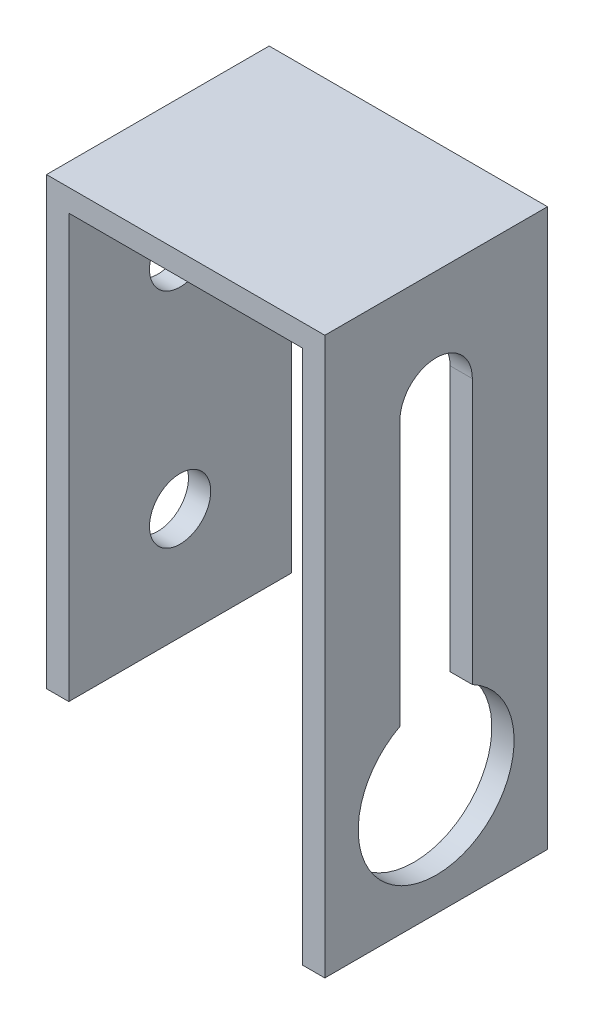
ISO-10303-21;
HEADER;
FILE_DESCRIPTION(('STEP AP214'),'2;1');
FILE_NAME('part.step','',(''),(''),'','','');
FILE_SCHEMA(('AUTOMOTIVE_DESIGN { 1 0 10303 214 1 1 1 1 }'));
ENDSEC;
DATA;
#1=APPLICATION_CONTEXT('core data for automotive mechanical design processes');
#2=APPLICATION_PROTOCOL_DEFINITION('international standard','automotive_design',2000,#1);
#3=PRODUCT_CONTEXT('',#1,'mechanical');
#4=PRODUCT('Part','Part','',(#3));
#5=PRODUCT_RELATED_PRODUCT_CATEGORY('part','',(#4));
#6=PRODUCT_DEFINITION_FORMATION('','',#4);
#7=PRODUCT_DEFINITION_CONTEXT('part definition',#1,'design');
#8=PRODUCT_DEFINITION('design','',#6,#7);
#9=PRODUCT_DEFINITION_SHAPE('','',#8);
#10=(LENGTH_UNIT() NAMED_UNIT(*) SI_UNIT(.MILLI.,.METRE.));
#11=(NAMED_UNIT(*) PLANE_ANGLE_UNIT() SI_UNIT($,.RADIAN.));
#12=(NAMED_UNIT(*) SI_UNIT($,.STERADIAN.) SOLID_ANGLE_UNIT());
#13=UNCERTAINTY_MEASURE_WITH_UNIT(LENGTH_MEASURE(1.E-05),#10,'distance_accuracy_value','');
#14=(GEOMETRIC_REPRESENTATION_CONTEXT(3) GLOBAL_UNCERTAINTY_ASSIGNED_CONTEXT((#13)) GLOBAL_UNIT_ASSIGNED_CONTEXT((#10,
#11,#12)) REPRESENTATION_CONTEXT('',''));
#15=CARTESIAN_POINT('',(0.,0.,0.));
#16=DIRECTION('',(0.,0.,1.));
#17=DIRECTION('',(1.,0.,0.));
#18=AXIS2_PLACEMENT_3D('',#15,#16,#17);
#19=CARTESIAN_POINT('',(2.,0.,20.));
#20=DIRECTION('',(0.,1.,0.));
#21=DIRECTION('',(0.,0.,1.));
#22=AXIS2_PLACEMENT_3D('',#19,#20,#21);
#23=PLANE('',#22);
#24=DIRECTION('',(1.,0.,0.));
#25=VECTOR('',#24,1.);
#26=CARTESIAN_POINT('',(2.,0.,0.));
#27=LINE('',#26,#25);
#28=CARTESIAN_POINT('',(0.,0.,0.));
#29=VERTEX_POINT('',#28);
#30=CARTESIAN_POINT('',(2.,0.,0.));
#31=VERTEX_POINT('',#30);
#32=EDGE_CURVE('E149',#29,#31,#27,.T.);
#33=ORIENTED_EDGE('',*,*,#32,.T.);
#34=DIRECTION('',(0.,0.,-1.));
#35=VECTOR('',#34,1.);
#36=CARTESIAN_POINT('',(2.,0.,20.));
#37=LINE('',#36,#35);
#38=CARTESIAN_POINT('',(2.,0.,20.));
#39=VERTEX_POINT('',#38);
#40=EDGE_CURVE('E11',#39,#31,#37,.T.);
#41=ORIENTED_EDGE('',*,*,#40,.F.);
#42=DIRECTION('',(1.,0.,0.));
#43=VECTOR('',#42,1.);
#44=CARTESIAN_POINT('',(2.,0.,20.));
#45=LINE('',#44,#43);
#46=CARTESIAN_POINT('',(0.,0.,20.));
#47=VERTEX_POINT('',#46);
#48=EDGE_CURVE('E152',#47,#39,#45,.T.);
#49=ORIENTED_EDGE('',*,*,#48,.F.);
#50=DIRECTION('',(0.,0.,-1.));
#51=VECTOR('',#50,1.);
#52=CARTESIAN_POINT('',(0.,0.,20.));
#53=LINE('',#52,#51);
#54=EDGE_CURVE('E170',#47,#29,#53,.T.);
#55=ORIENTED_EDGE('',*,*,#54,.T.);
#56=EDGE_LOOP('',(#33,#41,#49,#55));
#57=FACE_BOUND('',#56,.T.);
#58=ADVANCED_FACE('F33',(#57),#23,.F.);
#59=CARTESIAN_POINT('',(2.,0.,20.));
#60=DIRECTION('',(-1.,0.,0.));
#61=DIRECTION('',(0.,0.,1.));
#62=AXIS2_PLACEMENT_3D('',#59,#60,#61);
#63=PLANE('',#62);
#64=CARTESIAN_POINT('',(2.,10.,10.));
#65=DIRECTION('',(1.,0.,0.));
#66=DIRECTION('',(0.,0.,-1.));
#67=AXIS2_PLACEMENT_3D('',#64,#65,#66);
#68=CIRCLE('',#67,2.75);
#69=CARTESIAN_POINT('',(2.,10.,7.25));
#70=VERTEX_POINT('',#69);
#71=EDGE_CURVE('E283',#70,#70,#68,.T.);
#72=ORIENTED_EDGE('',*,*,#71,.F.);
#73=EDGE_LOOP('',(#72));
#74=FACE_BOUND('',#73,.T.);
#75=CARTESIAN_POINT('',(2.,30.,10.));
#76=DIRECTION('',(1.,0.,0.));
#77=DIRECTION('',(0.,0.,-1.));
#78=AXIS2_PLACEMENT_3D('',#75,#76,#77);
#79=CIRCLE('',#78,2.75);
#80=CARTESIAN_POINT('',(2.,30.,7.25));
#81=VERTEX_POINT('',#80);
#82=EDGE_CURVE('E277',#81,#81,#79,.T.);
#83=ORIENTED_EDGE('',*,*,#82,.F.);
#84=EDGE_LOOP('',(#83));
#85=FACE_BOUND('',#84,.T.);
#86=DIRECTION('',(0.,1.,0.));
#87=VECTOR('',#86,1.);
#88=CARTESIAN_POINT('',(2.,0.,0.));
#89=LINE('',#88,#87);
#90=CARTESIAN_POINT('',(2.,38.,0.));
#91=VERTEX_POINT('',#90);
#92=EDGE_CURVE('E173',#31,#91,#89,.T.);
#93=ORIENTED_EDGE('',*,*,#92,.T.);
#94=DIRECTION('',(0.,0.,-1.));
#95=VECTOR('',#94,1.);
#96=CARTESIAN_POINT('',(2.,38.,20.));
#97=LINE('',#96,#95);
#98=CARTESIAN_POINT('',(2.,38.,20.));
#99=VERTEX_POINT('',#98);
#100=EDGE_CURVE('E40',#99,#91,#97,.T.);
#101=ORIENTED_EDGE('',*,*,#100,.F.);
#102=DIRECTION('',(0.,1.,0.));
#103=VECTOR('',#102,1.);
#104=CARTESIAN_POINT('',(2.,0.,20.));
#105=LINE('',#104,#103);
#106=EDGE_CURVE('E155',#39,#99,#105,.T.);
#107=ORIENTED_EDGE('',*,*,#106,.F.);
#108=ORIENTED_EDGE('',*,*,#40,.T.);
#109=EDGE_LOOP('',(#93,#101,#107,#108));
#110=FACE_BOUND('',#109,.T.);
#111=ADVANCED_FACE('F230',(#74,#85,#110),#63,.F.);
#112=CARTESIAN_POINT('',(2.,38.,20.));
#113=DIRECTION('',(0.,1.,0.));
#114=DIRECTION('',(0.,0.,1.));
#115=AXIS2_PLACEMENT_3D('',#112,#113,#114);
#116=PLANE('',#115);
#117=DIRECTION('',(1.,0.,0.));
#118=VECTOR('',#117,1.);
#119=CARTESIAN_POINT('',(2.,38.,0.));
#120=LINE('',#119,#118);
#121=CARTESIAN_POINT('',(23.,38.,0.));
#122=VERTEX_POINT('',#121);
#123=EDGE_CURVE('E175',#91,#122,#120,.T.);
#124=ORIENTED_EDGE('',*,*,#123,.T.);
#125=DIRECTION('',(0.,0.,-1.));
#126=VECTOR('',#125,1.);
#127=CARTESIAN_POINT('',(23.,38.,20.));
#128=LINE('',#127,#126);
#129=CARTESIAN_POINT('',(23.,38.,20.));
#130=VERTEX_POINT('',#129);
#131=EDGE_CURVE('E200',#130,#122,#128,.T.);
#132=ORIENTED_EDGE('',*,*,#131,.F.);
#133=DIRECTION('',(1.,0.,0.));
#134=VECTOR('',#133,1.);
#135=CARTESIAN_POINT('',(2.,38.,20.));
#136=LINE('',#135,#134);
#137=EDGE_CURVE('E158',#99,#130,#136,.T.);
#138=ORIENTED_EDGE('',*,*,#137,.F.);
#139=ORIENTED_EDGE('',*,*,#100,.T.);
#140=EDGE_LOOP('',(#124,#132,#138,#139));
#141=FACE_BOUND('',#140,.T.);
#142=ADVANCED_FACE('F207',(#141),#116,.F.);
#143=CARTESIAN_POINT('',(23.,38.,20.));
#144=DIRECTION('',(1.,0.,0.));
#145=DIRECTION('',(0.,1.,0.));
#146=AXIS2_PLACEMENT_3D('',#143,#144,#145);
#147=PLANE('',#146);
#148=DIRECTION('',(0.,-1.,0.));
#149=VECTOR('',#148,1.);
#150=CARTESIAN_POINT('',(23.,30.,13.25));
#151=LINE('',#150,#149);
#152=CARTESIAN_POINT('',(23.,30.,13.25));
#153=VERTEX_POINT('',#152);
#154=CARTESIAN_POINT('',(23.,6.19979838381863,13.25));
#155=VERTEX_POINT('',#154);
#156=EDGE_CURVE('E267',#153,#155,#151,.T.);
#157=ORIENTED_EDGE('',*,*,#156,.T.);
#158=CARTESIAN_POINT('',(23.,0.,10.));
#159=DIRECTION('',(1.,0.,0.));
#160=DIRECTION('',(0.,1.,0.));
#161=AXIS2_PLACEMENT_3D('',#158,#159,#160);
#162=CIRCLE('',#161,7.);
#163=CARTESIAN_POINT('',(23.,6.19979838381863,6.75000000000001));
#164=VERTEX_POINT('',#163);
#165=EDGE_CURVE('E47',#164,#155,#162,.F.);
#166=ORIENTED_EDGE('',*,*,#165,.F.);
#167=DIRECTION('',(0.,1.,0.));
#168=VECTOR('',#167,1.);
#169=CARTESIAN_POINT('',(23.,30.,6.75000000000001));
#170=LINE('',#169,#168);
#171=CARTESIAN_POINT('',(23.,30.,6.75000000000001));
#172=VERTEX_POINT('',#171);
#173=EDGE_CURVE('E151',#164,#172,#170,.T.);
#174=ORIENTED_EDGE('',*,*,#173,.T.);
#175=CARTESIAN_POINT('',(23.,30.,10.));
#176=DIRECTION('',(1.,0.,0.));
#177=DIRECTION('',(0.,1.,0.));
#178=AXIS2_PLACEMENT_3D('',#175,#176,#177);
#179=CIRCLE('',#178,3.24999999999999);
#180=EDGE_CURVE('E142',#172,#153,#179,.T.);
#181=ORIENTED_EDGE('',*,*,#180,.T.);
#182=EDGE_LOOP('',(#157,#166,#174,#181));
#183=FACE_BOUND('',#182,.T.);
#184=DIRECTION('',(0.,-1.,0.));
#185=VECTOR('',#184,1.);
#186=CARTESIAN_POINT('',(23.,38.,0.));
#187=LINE('',#186,#185);
#188=CARTESIAN_POINT('',(23.,-10.,0.));
#189=VERTEX_POINT('',#188);
#190=EDGE_CURVE('E177',#122,#189,#187,.T.);
#191=ORIENTED_EDGE('',*,*,#190,.T.);
#192=DIRECTION('',(0.,0.,-1.));
#193=VECTOR('',#192,1.);
#194=CARTESIAN_POINT('',(23.,-10.,20.));
#195=LINE('',#194,#193);
#196=CARTESIAN_POINT('',(23.,-10.,20.));
#197=VERTEX_POINT('',#196);
#198=EDGE_CURVE('E197',#197,#189,#195,.T.);
#199=ORIENTED_EDGE('',*,*,#198,.F.);
#200=DIRECTION('',(0.,-1.,0.));
#201=VECTOR('',#200,1.);
#202=CARTESIAN_POINT('',(23.,38.,20.));
#203=LINE('',#202,#201);
#204=EDGE_CURVE('E160',#130,#197,#203,.T.);
#205=ORIENTED_EDGE('',*,*,#204,.F.);
#206=ORIENTED_EDGE('',*,*,#131,.T.);
#207=EDGE_LOOP('',(#191,#199,#205,#206));
#208=FACE_BOUND('',#207,.T.);
#209=ADVANCED_FACE('F218',(#183,#208),#147,.F.);
#210=CARTESIAN_POINT('',(25.,-10.,20.));
#211=DIRECTION('',(0.,1.,0.));
#212=DIRECTION('',(0.,0.,1.));
#213=AXIS2_PLACEMENT_3D('',#210,#211,#212);
#214=PLANE('',#213);
#215=DIRECTION('',(1.,0.,0.));
#216=VECTOR('',#215,1.);
#217=CARTESIAN_POINT('',(25.,-10.,0.));
#218=LINE('',#217,#216);
#219=CARTESIAN_POINT('',(25.,-10.,0.));
#220=VERTEX_POINT('',#219);
#221=EDGE_CURVE('E179',#189,#220,#218,.T.);
#222=ORIENTED_EDGE('',*,*,#221,.T.);
#223=DIRECTION('',(0.,0.,-1.));
#224=VECTOR('',#223,1.);
#225=CARTESIAN_POINT('',(25.,-10.,20.));
#226=LINE('',#225,#224);
#227=CARTESIAN_POINT('',(25.,-10.,20.));
#228=VERTEX_POINT('',#227);
#229=EDGE_CURVE('E194',#228,#220,#226,.T.);
#230=ORIENTED_EDGE('',*,*,#229,.F.);
#231=DIRECTION('',(1.,0.,0.));
#232=VECTOR('',#231,1.);
#233=CARTESIAN_POINT('',(25.,-10.,20.));
#234=LINE('',#233,#232);
#235=EDGE_CURVE('E162',#197,#228,#234,.T.);
#236=ORIENTED_EDGE('',*,*,#235,.F.);
#237=ORIENTED_EDGE('',*,*,#198,.T.);
#238=EDGE_LOOP('',(#222,#230,#236,#237));
#239=FACE_BOUND('',#238,.T.);
#240=ADVANCED_FACE('F222',(#239),#214,.F.);
#241=CARTESIAN_POINT('',(25.,40.,20.));
#242=DIRECTION('',(-1.,0.,0.));
#243=DIRECTION('',(0.,-1.,0.));
#244=AXIS2_PLACEMENT_3D('',#241,#242,#243);
#245=PLANE('',#244);
#246=DIRECTION('',(0.,1.,0.));
#247=VECTOR('',#246,1.);
#248=CARTESIAN_POINT('',(25.,30.,6.75000000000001));
#249=LINE('',#248,#247);
#250=CARTESIAN_POINT('',(25.,6.19979838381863,6.75000000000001));
#251=VERTEX_POINT('',#250);
#252=CARTESIAN_POINT('',(25.,30.,6.75000000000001));
#253=VERTEX_POINT('',#252);
#254=EDGE_CURVE('E137',#251,#253,#249,.T.);
#255=ORIENTED_EDGE('',*,*,#254,.F.);
#256=CARTESIAN_POINT('',(25.,0.,10.));
#257=DIRECTION('',(1.,0.,0.));
#258=DIRECTION('',(0.,1.,0.));
#259=AXIS2_PLACEMENT_3D('',#256,#257,#258);
#260=CIRCLE('',#259,7.);
#261=CARTESIAN_POINT('',(25.,6.19979838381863,13.25));
#262=VERTEX_POINT('',#261);
#263=EDGE_CURVE('E122',#262,#251,#260,.T.);
#264=ORIENTED_EDGE('',*,*,#263,.F.);
#265=DIRECTION('',(0.,-1.,0.));
#266=VECTOR('',#265,1.);
#267=CARTESIAN_POINT('',(25.,30.,13.25));
#268=LINE('',#267,#266);
#269=CARTESIAN_POINT('',(25.,30.,13.25));
#270=VERTEX_POINT('',#269);
#271=EDGE_CURVE('E136',#270,#262,#268,.T.);
#272=ORIENTED_EDGE('',*,*,#271,.F.);
#273=CARTESIAN_POINT('',(25.,30.,10.));
#274=DIRECTION('',(1.,0.,0.));
#275=DIRECTION('',(0.,1.,0.));
#276=AXIS2_PLACEMENT_3D('',#273,#274,#275);
#277=CIRCLE('',#276,3.24999999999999);
#278=EDGE_CURVE('E55',#253,#270,#277,.T.);
#279=ORIENTED_EDGE('',*,*,#278,.F.);
#280=EDGE_LOOP('',(#255,#264,#272,#279));
#281=FACE_BOUND('',#280,.T.);
#282=DIRECTION('',(0.,1.,0.));
#283=VECTOR('',#282,1.);
#284=CARTESIAN_POINT('',(25.,40.,0.));
#285=LINE('',#284,#283);
#286=CARTESIAN_POINT('',(25.,40.,0.));
#287=VERTEX_POINT('',#286);
#288=EDGE_CURVE('E181',#220,#287,#285,.T.);
#289=ORIENTED_EDGE('',*,*,#288,.T.);
#290=DIRECTION('',(0.,0.,-1.));
#291=VECTOR('',#290,1.);
#292=CARTESIAN_POINT('',(25.,40.,20.));
#293=LINE('',#292,#291);
#294=CARTESIAN_POINT('',(25.,40.,20.));
#295=VERTEX_POINT('',#294);
#296=EDGE_CURVE('E191',#295,#287,#293,.T.);
#297=ORIENTED_EDGE('',*,*,#296,.F.);
#298=DIRECTION('',(0.,1.,0.));
#299=VECTOR('',#298,1.);
#300=CARTESIAN_POINT('',(25.,40.,20.));
#301=LINE('',#300,#299);
#302=EDGE_CURVE('E164',#228,#295,#301,.T.);
#303=ORIENTED_EDGE('',*,*,#302,.F.);
#304=ORIENTED_EDGE('',*,*,#229,.T.);
#305=EDGE_LOOP('',(#289,#297,#303,#304));
#306=FACE_BOUND('',#305,.T.);
#307=ADVANCED_FACE('F134',(#281,#306),#245,.F.);
#308=CARTESIAN_POINT('',(0.,40.,20.));
#309=DIRECTION('',(0.,-1.,0.));
#310=DIRECTION('',(0.,0.,-1.));
#311=AXIS2_PLACEMENT_3D('',#308,#309,#310);
#312=PLANE('',#311);
#313=DIRECTION('',(-1.,0.,0.));
#314=VECTOR('',#313,1.);
#315=CARTESIAN_POINT('',(0.,40.,0.));
#316=LINE('',#315,#314);
#317=CARTESIAN_POINT('',(0.,40.,0.));
#318=VERTEX_POINT('',#317);
#319=EDGE_CURVE('E183',#287,#318,#316,.T.);
#320=ORIENTED_EDGE('',*,*,#319,.T.);
#321=DIRECTION('',(0.,0.,-1.));
#322=VECTOR('',#321,1.);
#323=CARTESIAN_POINT('',(0.,40.,20.));
#324=LINE('',#323,#322);
#325=CARTESIAN_POINT('',(0.,40.,20.));
#326=VERTEX_POINT('',#325);
#327=EDGE_CURVE('E188',#326,#318,#324,.T.);
#328=ORIENTED_EDGE('',*,*,#327,.F.);
#329=DIRECTION('',(-1.,0.,0.));
#330=VECTOR('',#329,1.);
#331=CARTESIAN_POINT('',(0.,40.,20.));
#332=LINE('',#331,#330);
#333=EDGE_CURVE('E166',#295,#326,#332,.T.);
#334=ORIENTED_EDGE('',*,*,#333,.F.);
#335=ORIENTED_EDGE('',*,*,#296,.T.);
#336=EDGE_LOOP('',(#320,#328,#334,#335));
#337=FACE_BOUND('',#336,.T.);
#338=ADVANCED_FACE('F241',(#337),#312,.F.);
#339=CARTESIAN_POINT('',(0.,0.,20.));
#340=DIRECTION('',(1.,0.,0.));
#341=DIRECTION('',(0.,0.,-1.));
#342=AXIS2_PLACEMENT_3D('',#339,#340,#341);
#343=PLANE('',#342);
#344=CARTESIAN_POINT('',(0.,10.,10.));
#345=DIRECTION('',(1.,0.,0.));
#346=DIRECTION('',(0.,0.,-1.));
#347=AXIS2_PLACEMENT_3D('',#344,#345,#346);
#348=CIRCLE('',#347,2.75);
#349=CARTESIAN_POINT('',(0.,10.,7.25));
#350=VERTEX_POINT('',#349);
#351=EDGE_CURVE('E280',#350,#350,#348,.F.);
#352=ORIENTED_EDGE('',*,*,#351,.F.);
#353=EDGE_LOOP('',(#352));
#354=FACE_BOUND('',#353,.T.);
#355=CARTESIAN_POINT('',(0.,30.,10.));
#356=DIRECTION('',(1.,0.,0.));
#357=DIRECTION('',(0.,0.,-1.));
#358=AXIS2_PLACEMENT_3D('',#355,#356,#357);
#359=CIRCLE('',#358,2.75);
#360=CARTESIAN_POINT('',(0.,30.,7.25));
#361=VERTEX_POINT('',#360);
#362=EDGE_CURVE('E129',#361,#361,#359,.F.);
#363=ORIENTED_EDGE('',*,*,#362,.F.);
#364=EDGE_LOOP('',(#363));
#365=FACE_BOUND('',#364,.T.);
#366=DIRECTION('',(0.,-1.,0.));
#367=VECTOR('',#366,1.);
#368=CARTESIAN_POINT('',(0.,0.,0.));
#369=LINE('',#368,#367);
#370=EDGE_CURVE('E156',#318,#29,#369,.T.);
#371=ORIENTED_EDGE('',*,*,#370,.T.);
#372=ORIENTED_EDGE('',*,*,#54,.F.);
#373=DIRECTION('',(0.,-1.,0.));
#374=VECTOR('',#373,1.);
#375=CARTESIAN_POINT('',(0.,0.,20.));
#376=LINE('',#375,#374);
#377=EDGE_CURVE('E168',#326,#47,#376,.T.);
#378=ORIENTED_EDGE('',*,*,#377,.F.);
#379=ORIENTED_EDGE('',*,*,#327,.T.);
#380=EDGE_LOOP('',(#371,#372,#378,#379));
#381=FACE_BOUND('',#380,.T.);
#382=ADVANCED_FACE('F236',(#354,#365,#381),#343,.F.);
#383=CARTESIAN_POINT('',(0.,0.,20.));
#384=DIRECTION('',(0.,0.,-1.));
#385=DIRECTION('',(-1.,0.,0.));
#386=AXIS2_PLACEMENT_3D('',#383,#384,#385);
#387=PLANE('',#386);
#388=ORIENTED_EDGE('',*,*,#48,.T.);
#389=ORIENTED_EDGE('',*,*,#106,.T.);
#390=ORIENTED_EDGE('',*,*,#137,.T.);
#391=ORIENTED_EDGE('',*,*,#204,.T.);
#392=ORIENTED_EDGE('',*,*,#235,.T.);
#393=ORIENTED_EDGE('',*,*,#302,.T.);
#394=ORIENTED_EDGE('',*,*,#333,.T.);
#395=ORIENTED_EDGE('',*,*,#377,.T.);
#396=EDGE_LOOP('',(#388,#389,#390,#391,#392,#393,#394,#395));
#397=FACE_BOUND('',#396,.T.);
#398=ADVANCED_FACE('F226',(#397),#387,.F.);
#399=CARTESIAN_POINT('',(0.,0.,0.));
#400=DIRECTION('',(0.,0.,-1.));
#401=DIRECTION('',(-1.,0.,0.));
#402=AXIS2_PLACEMENT_3D('',#399,#400,#401);
#403=PLANE('',#402);
#404=ORIENTED_EDGE('',*,*,#32,.F.);
#405=ORIENTED_EDGE('',*,*,#370,.F.);
#406=ORIENTED_EDGE('',*,*,#319,.F.);
#407=ORIENTED_EDGE('',*,*,#288,.F.);
#408=ORIENTED_EDGE('',*,*,#221,.F.);
#409=ORIENTED_EDGE('',*,*,#190,.F.);
#410=ORIENTED_EDGE('',*,*,#123,.F.);
#411=ORIENTED_EDGE('',*,*,#92,.F.);
#412=EDGE_LOOP('',(#404,#405,#406,#407,#408,#409,#410,#411));
#413=FACE_BOUND('',#412,.T.);
#414=ADVANCED_FACE('F213',(#413),#403,.T.);
#415=CARTESIAN_POINT('',(23.,30.,10.));
#416=DIRECTION('',(1.,0.,0.));
#417=DIRECTION('',(0.,1.,0.));
#418=AXIS2_PLACEMENT_3D('',#415,#416,#417);
#419=CYLINDRICAL_SURFACE('',#418,3.24999999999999);
#420=ORIENTED_EDGE('',*,*,#278,.T.);
#421=DIRECTION('',(1.,0.,0.));
#422=VECTOR('',#421,1.);
#423=CARTESIAN_POINT('',(23.,30.,13.25));
#424=LINE('',#423,#422);
#425=EDGE_CURVE('E140',#153,#270,#424,.T.);
#426=ORIENTED_EDGE('',*,*,#425,.F.);
#427=ORIENTED_EDGE('',*,*,#180,.F.);
#428=DIRECTION('',(1.,0.,0.));
#429=VECTOR('',#428,1.);
#430=CARTESIAN_POINT('',(23.,30.,6.75000000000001));
#431=LINE('',#430,#429);
#432=EDGE_CURVE('E147',#172,#253,#431,.T.);
#433=ORIENTED_EDGE('',*,*,#432,.T.);
#434=EDGE_LOOP('',(#420,#426,#427,#433));
#435=FACE_BOUND('',#434,.T.);
#436=ADVANCED_FACE('F309',(#435),#419,.F.);
#437=CARTESIAN_POINT('',(23.,30.,6.75000000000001));
#438=DIRECTION('',(0.,0.,-1.));
#439=DIRECTION('',(0.,1.,0.));
#440=AXIS2_PLACEMENT_3D('',#437,#438,#439);
#441=PLANE('',#440);
#442=ORIENTED_EDGE('',*,*,#173,.F.);
#443=DIRECTION('',(1.,0.,0.));
#444=VECTOR('',#443,1.);
#445=CARTESIAN_POINT('',(-0.00100000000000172,6.19979838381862,6.75000000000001));
#446=LINE('',#445,#444);
#447=EDGE_CURVE('E128',#251,#164,#446,.F.);
#448=ORIENTED_EDGE('',*,*,#447,.F.);
#449=ORIENTED_EDGE('',*,*,#254,.T.);
#450=ORIENTED_EDGE('',*,*,#432,.F.);
#451=EDGE_LOOP('',(#442,#448,#449,#450));
#452=FACE_BOUND('',#451,.T.);
#453=ADVANCED_FACE('F306',(#452),#441,.F.);
#454=CARTESIAN_POINT('',(23.,30.,13.25));
#455=DIRECTION('',(0.,0.,1.));
#456=DIRECTION('',(0.,-1.,0.));
#457=AXIS2_PLACEMENT_3D('',#454,#455,#456);
#458=PLANE('',#457);
#459=ORIENTED_EDGE('',*,*,#271,.T.);
#460=DIRECTION('',(1.,0.,0.));
#461=VECTOR('',#460,1.);
#462=CARTESIAN_POINT('',(-0.00100000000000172,6.19979838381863,13.25));
#463=LINE('',#462,#461);
#464=EDGE_CURVE('E119',#155,#262,#463,.T.);
#465=ORIENTED_EDGE('',*,*,#464,.F.);
#466=ORIENTED_EDGE('',*,*,#156,.F.);
#467=ORIENTED_EDGE('',*,*,#425,.T.);
#468=EDGE_LOOP('',(#459,#465,#466,#467));
#469=FACE_BOUND('',#468,.T.);
#470=ADVANCED_FACE('F139',(#469),#458,.F.);
#471=CARTESIAN_POINT('',(-0.001000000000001,0.,10.));
#472=DIRECTION('',(1.,0.,0.));
#473=DIRECTION('',(0.,1.,0.));
#474=AXIS2_PLACEMENT_3D('',#471,#472,#473);
#475=CYLINDRICAL_SURFACE('',#474,7.);
#476=ORIENTED_EDGE('',*,*,#447,.T.);
#477=ORIENTED_EDGE('',*,*,#165,.T.);
#478=ORIENTED_EDGE('',*,*,#464,.T.);
#479=ORIENTED_EDGE('',*,*,#263,.T.);
#480=EDGE_LOOP('',(#476,#477,#478,#479));
#481=FACE_BOUND('',#480,.T.);
#482=ADVANCED_FACE('F121',(#481),#475,.F.);
#483=CARTESIAN_POINT('',(-0.00100000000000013,30.,10.));
#484=DIRECTION('',(1.,0.,0.));
#485=DIRECTION('',(0.,0.,-1.));
#486=AXIS2_PLACEMENT_3D('',#483,#484,#485);
#487=CYLINDRICAL_SURFACE('',#486,2.75);
#488=ORIENTED_EDGE('',*,*,#82,.T.);
#489=EDGE_LOOP('',(#488));
#490=FACE_BOUND('',#489,.T.);
#491=ORIENTED_EDGE('',*,*,#362,.T.);
#492=EDGE_LOOP('',(#491));
#493=FACE_BOUND('',#492,.T.);
#494=ADVANCED_FACE('F289',(#490,#493),#487,.F.);
#495=CARTESIAN_POINT('',(-0.00100000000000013,10.,10.));
#496=DIRECTION('',(1.,0.,0.));
#497=DIRECTION('',(0.,0.,-1.));
#498=AXIS2_PLACEMENT_3D('',#495,#496,#497);
#499=CYLINDRICAL_SURFACE('',#498,2.75);
#500=ORIENTED_EDGE('',*,*,#71,.T.);
#501=EDGE_LOOP('',(#500));
#502=FACE_BOUND('',#501,.T.);
#503=ORIENTED_EDGE('',*,*,#351,.T.);
#504=EDGE_LOOP('',(#503));
#505=FACE_BOUND('',#504,.T.);
#506=ADVANCED_FACE('F286',(#502,#505),#499,.F.);
#507=CLOSED_SHELL('',(#58,#111,#142,#209,#240,#307,#338,#382,#398,#414,#436,#453,#470,#482,#494,#506));
#508=MANIFOLD_SOLID_BREP('B2',#507);
#509=ADVANCED_BREP_SHAPE_REPRESENTATION('',(#18,#508),#14);
#510=SHAPE_DEFINITION_REPRESENTATION(#9,#509);
ENDSEC;
END-ISO-10303-21;
